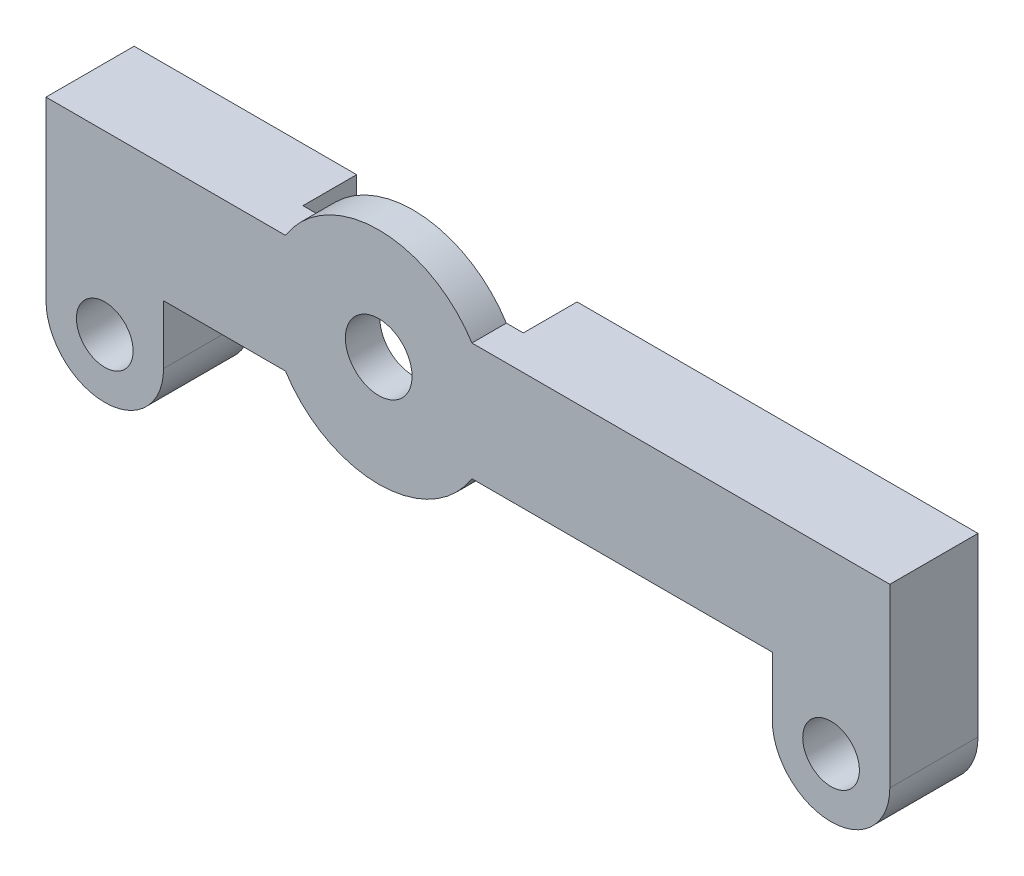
from build123d import *

# Parameters (mm, degrees)
SKETCH1_R              = 1.35
SKETCH1_R_2            = 1.5875
BODY_DEPTH             = 4.2
SKETCH2_W              = 10.5
SKETCH2_H              = 5.6
PULLEY_CLEARANCE_DEPTH = 2.56
SKETCH3_R              = 5.25
SKETCH3_R_2            = 1.625
PULLEY_BLOCK_DEPTH     = 1.64


with BuildPart() as part:
    # Sketch1 → Body (new body)
    with BuildSketch(Plane.XY):
        with BuildLine():
            Line((-14.5, 0), (-14.5, 2.8))
            Line((-14.5, 2.8), (14.5, 2.8))
            Line((14.5, 2.8), (14.5, 0))
            ThreePointArc((14.5, 0), (17.3, -2.8), (20.1, 0))
            Line((20.1, 0), (20.1, 8.4))
            Line((20.1, 8.4), (-20.1, 8.4))
            Line((-20.1, 8.4), (-20.1, 0))
            ThreePointArc((-20.1, 0), (-17.3, -2.8), (-14.5, 0))
        make_face()
        with Locations((-17.3, 0)):
            Circle(SKETCH1_R, mode=Mode.SUBTRACT)
        with Locations((-4.25, 5.6)):
            Circle(SKETCH1_R_2, mode=Mode.SUBTRACT)
        with Locations(Location((17.3, 0, 0), (0, 0, 180))):
            Circle(SKETCH1_R, mode=Mode.SUBTRACT)
    extrude(amount=BODY_DEPTH)

    # Sketch2 → Pulley Clearance (cut)
    with BuildSketch(Plane(origin=(0, 0, 0), x_dir=(-1, 0, 0), z_dir=(0, 0, -1))):
        with Locations((4.25, 5.6)):
            Rectangle(SKETCH2_W, SKETCH2_H)
    extrude(amount=-PULLEY_CLEARANCE_DEPTH, mode=Mode.SUBTRACT)

    # Sketch3 → Pulley Block (add)
    with BuildSketch(Plane.XY.offset(4.2)):
        with Locations((-4.25, 5.6)):
            Circle(SKETCH3_R)
        with Locations((-4.25, 5.6)):
            Circle(SKETCH3_R_2, mode=Mode.SUBTRACT)
    extrude(amount=-PULLEY_BLOCK_DEPTH)


solid = part.part
